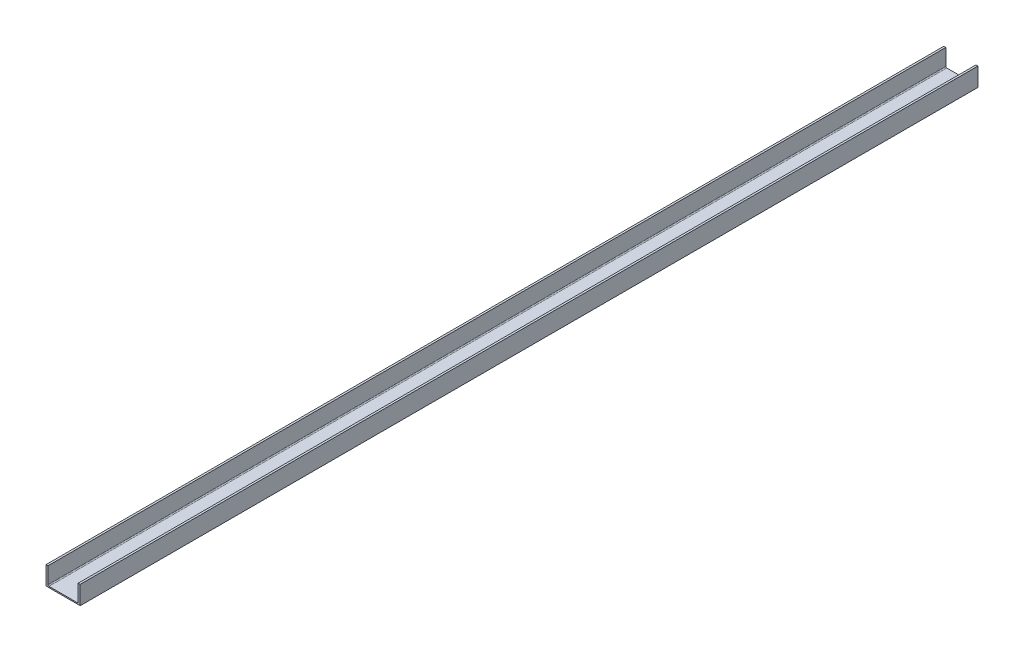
ISO-10303-21;
HEADER;
FILE_DESCRIPTION(('STEP AP214'),'2;1');
FILE_NAME('part.step','',(''),(''),'','','');
FILE_SCHEMA(('AUTOMOTIVE_DESIGN { 1 0 10303 214 1 1 1 1 }'));
ENDSEC;
DATA;
#1=APPLICATION_CONTEXT('core data for automotive mechanical design processes');
#2=APPLICATION_PROTOCOL_DEFINITION('international standard','automotive_design',2000,#1);
#3=PRODUCT_CONTEXT('',#1,'mechanical');
#4=PRODUCT('Part','Part','',(#3));
#5=PRODUCT_RELATED_PRODUCT_CATEGORY('part','',(#4));
#6=PRODUCT_DEFINITION_FORMATION('','',#4);
#7=PRODUCT_DEFINITION_CONTEXT('part definition',#1,'design');
#8=PRODUCT_DEFINITION('design','',#6,#7);
#9=PRODUCT_DEFINITION_SHAPE('','',#8);
#10=(LENGTH_UNIT() NAMED_UNIT(*) SI_UNIT(.MILLI.,.METRE.));
#11=(NAMED_UNIT(*) PLANE_ANGLE_UNIT() SI_UNIT($,.RADIAN.));
#12=(NAMED_UNIT(*) SI_UNIT($,.STERADIAN.) SOLID_ANGLE_UNIT());
#13=UNCERTAINTY_MEASURE_WITH_UNIT(LENGTH_MEASURE(1.E-05),#10,'distance_accuracy_value','');
#14=(GEOMETRIC_REPRESENTATION_CONTEXT(3) GLOBAL_UNCERTAINTY_ASSIGNED_CONTEXT((#13)) GLOBAL_UNIT_ASSIGNED_CONTEXT((#10,
#11,#12)) REPRESENTATION_CONTEXT('',''));
#15=CARTESIAN_POINT('',(0.,0.,0.));
#16=DIRECTION('',(0.,0.,1.));
#17=DIRECTION('',(1.,0.,0.));
#18=AXIS2_PLACEMENT_3D('',#15,#16,#17);
#19=CARTESIAN_POINT('',(-67.3100000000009,41.2749999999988,2000.18000000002));
#20=DIRECTION('',(0.,-1.,0.));
#21=DIRECTION('',(0.,0.,-1.00000000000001));
#22=AXIS2_PLACEMENT_3D('',#19,#20,#21);
#23=PLANE('',#22);
#24=DIRECTION('',(-1.00000000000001,0.,0.));
#25=VECTOR('',#24,1.);
#26=CARTESIAN_POINT('',(-67.3099999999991,41.2749999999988,-2000.18));
#27=LINE('',#26,#25);
#28=CARTESIAN_POINT('',(-67.3099999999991,41.2749999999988,-2000.18));
#29=VERTEX_POINT('',#28);
#30=CARTESIAN_POINT('',(-76.2,41.2749999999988,-2000.18));
#31=VERTEX_POINT('',#30);
#32=EDGE_CURVE('E189',#29,#31,#27,.T.);
#33=ORIENTED_EDGE('',*,*,#32,.T.);
#34=DIRECTION('',(0.,0.,-1.00000000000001));
#35=VECTOR('',#34,1.);
#36=CARTESIAN_POINT('',(-76.2,41.2749999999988,2000.18000000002));
#37=LINE('',#36,#35);
#38=CARTESIAN_POINT('',(-76.2,41.2749999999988,2000.18000000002));
#39=VERTEX_POINT('',#38);
#40=EDGE_CURVE('E169',#39,#31,#37,.T.);
#41=ORIENTED_EDGE('',*,*,#40,.F.);
#42=DIRECTION('',(-1.00000000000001,0.,0.));
#43=VECTOR('',#42,1.);
#44=CARTESIAN_POINT('',(-67.3100000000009,41.2749999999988,2000.18000000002));
#45=LINE('',#44,#43);
#46=CARTESIAN_POINT('',(-67.3100000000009,41.2749999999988,2000.18000000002));
#47=VERTEX_POINT('',#46);
#48=EDGE_CURVE('E176',#47,#39,#45,.T.);
#49=ORIENTED_EDGE('',*,*,#48,.F.);
#50=DIRECTION('',(0.,0.,-1.00000000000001));
#51=VECTOR('',#50,1.);
#52=CARTESIAN_POINT('',(-67.3100000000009,41.2749999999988,2000.18000000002));
#53=LINE('',#52,#51);
#54=EDGE_CURVE('E235',#47,#29,#53,.T.);
#55=ORIENTED_EDGE('',*,*,#54,.T.);
#56=EDGE_LOOP('',(#33,#41,#49,#55));
#57=FACE_BOUND('',#56,.T.);
#58=ADVANCED_FACE('F89',(#57),#23,.F.);
#59=CARTESIAN_POINT('',(-76.2,41.2749999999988,2000.18000000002));
#60=DIRECTION('',(1.00000000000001,0.,0.));
#61=DIRECTION('',(0.,1.,0.));
#62=AXIS2_PLACEMENT_3D('',#59,#60,#61);
#63=PLANE('',#62);
#64=DIRECTION('',(0.,-1.,0.));
#65=VECTOR('',#64,1.);
#66=CARTESIAN_POINT('',(-76.2,41.2749999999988,-2000.18));
#67=LINE('',#66,#65);
#68=CARTESIAN_POINT('',(-76.2,-41.2749999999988,-2000.18));
#69=VERTEX_POINT('',#68);
#70=EDGE_CURVE('E250',#31,#69,#67,.T.);
#71=ORIENTED_EDGE('',*,*,#70,.T.);
#72=DIRECTION('',(0.,0.,-1.00000000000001));
#73=VECTOR('',#72,1.);
#74=CARTESIAN_POINT('',(-76.2,-41.2749999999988,2000.18000000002));
#75=LINE('',#74,#73);
#76=CARTESIAN_POINT('',(-76.2,-41.2749999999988,2000.18000000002));
#77=VERTEX_POINT('',#76);
#78=EDGE_CURVE('E175',#77,#69,#75,.T.);
#79=ORIENTED_EDGE('',*,*,#78,.F.);
#80=DIRECTION('',(0.,-1.,0.));
#81=VECTOR('',#80,1.);
#82=CARTESIAN_POINT('',(-76.2,41.2749999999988,2000.18000000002));
#83=LINE('',#82,#81);
#84=EDGE_CURVE('E164',#39,#77,#83,.T.);
#85=ORIENTED_EDGE('',*,*,#84,.F.);
#86=ORIENTED_EDGE('',*,*,#40,.T.);
#87=EDGE_LOOP('',(#71,#79,#85,#86));
#88=FACE_BOUND('',#87,.T.);
#89=ADVANCED_FACE('F170',(#88),#63,.F.);
#90=CARTESIAN_POINT('',(-76.2,-41.2749999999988,2000.18000000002));
#91=DIRECTION('',(0.,1.,0.));
#92=DIRECTION('',(-1.00000000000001,0.,0.));
#93=AXIS2_PLACEMENT_3D('',#90,#91,#92);
#94=PLANE('',#93);
#95=DIRECTION('',(1.00000000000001,0.,0.));
#96=VECTOR('',#95,1.);
#97=CARTESIAN_POINT('',(-76.2,-41.2749999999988,-2000.18));
#98=LINE('',#97,#96);
#99=CARTESIAN_POINT('',(76.2,-41.2749999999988,-2000.18000000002));
#100=VERTEX_POINT('',#99);
#101=EDGE_CURVE('E249',#69,#100,#98,.T.);
#102=ORIENTED_EDGE('',*,*,#101,.T.);
#103=DIRECTION('',(0.,0.,-1.00000000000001));
#104=VECTOR('',#103,1.);
#105=CARTESIAN_POINT('',(76.2,-41.2749999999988,2000.18000000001));
#106=LINE('',#105,#104);
#107=CARTESIAN_POINT('',(76.2,-41.2749999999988,2000.18000000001));
#108=VERTEX_POINT('',#107);
#109=EDGE_CURVE('E197',#108,#100,#106,.T.);
#110=ORIENTED_EDGE('',*,*,#109,.F.);
#111=DIRECTION('',(1.00000000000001,0.,0.));
#112=VECTOR('',#111,1.);
#113=CARTESIAN_POINT('',(-76.2,-41.2749999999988,2000.18000000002));
#114=LINE('',#113,#112);
#115=EDGE_CURVE('E174',#77,#108,#114,.T.);
#116=ORIENTED_EDGE('',*,*,#115,.F.);
#117=ORIENTED_EDGE('',*,*,#78,.T.);
#118=EDGE_LOOP('',(#102,#110,#116,#117));
#119=FACE_BOUND('',#118,.T.);
#120=ADVANCED_FACE('F302',(#119),#94,.F.);
#121=CARTESIAN_POINT('',(76.2,-41.2749999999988,2000.18000000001));
#122=DIRECTION('',(-1.00000000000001,0.,0.));
#123=DIRECTION('',(0.,-1.,0.));
#124=AXIS2_PLACEMENT_3D('',#121,#122,#123);
#125=PLANE('',#124);
#126=DIRECTION('',(0.,1.,0.));
#127=VECTOR('',#126,1.);
#128=CARTESIAN_POINT('',(76.2,-41.2749999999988,-2000.18000000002));
#129=LINE('',#128,#127);
#130=CARTESIAN_POINT('',(76.2,41.2749999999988,-2000.18000000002));
#131=VERTEX_POINT('',#130);
#132=EDGE_CURVE('E254',#100,#131,#129,.T.);
#133=ORIENTED_EDGE('',*,*,#132,.T.);
#134=DIRECTION('',(0.,0.,-1.00000000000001));
#135=VECTOR('',#134,1.);
#136=CARTESIAN_POINT('',(76.2,41.2749999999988,2000.18000000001));
#137=LINE('',#136,#135);
#138=CARTESIAN_POINT('',(76.2,41.2749999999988,2000.18000000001));
#139=VERTEX_POINT('',#138);
#140=EDGE_CURVE('E267',#139,#131,#137,.T.);
#141=ORIENTED_EDGE('',*,*,#140,.F.);
#142=DIRECTION('',(0.,1.,0.));
#143=VECTOR('',#142,1.);
#144=CARTESIAN_POINT('',(76.2,-41.2749999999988,2000.18000000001));
#145=LINE('',#144,#143);
#146=EDGE_CURVE('E278',#108,#139,#145,.T.);
#147=ORIENTED_EDGE('',*,*,#146,.F.);
#148=ORIENTED_EDGE('',*,*,#109,.T.);
#149=EDGE_LOOP('',(#133,#141,#147,#148));
#150=FACE_BOUND('',#149,.T.);
#151=ADVANCED_FACE('F276',(#150),#125,.F.);
#152=CARTESIAN_POINT('',(76.2,41.2749999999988,2000.18000000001));
#153=DIRECTION('',(0.,-1.,0.));
#154=DIRECTION('',(1.00000000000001,0.,0.));
#155=AXIS2_PLACEMENT_3D('',#152,#153,#154);
#156=PLANE('',#155);
#157=DIRECTION('',(-1.00000000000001,0.,0.));
#158=VECTOR('',#157,1.);
#159=CARTESIAN_POINT('',(76.2,41.2749999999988,-2000.18000000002));
#160=LINE('',#159,#158);
#161=CARTESIAN_POINT('',(67.3100000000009,41.2749999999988,-2000.18000000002));
#162=VERTEX_POINT('',#161);
#163=EDGE_CURVE('E259',#131,#162,#160,.T.);
#164=ORIENTED_EDGE('',*,*,#163,.T.);
#165=DIRECTION('',(0.,0.,-1.00000000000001));
#166=VECTOR('',#165,1.);
#167=CARTESIAN_POINT('',(67.3099999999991,41.2749999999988,2000.18000000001));
#168=LINE('',#167,#166);
#169=CARTESIAN_POINT('',(67.3099999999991,41.2749999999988,2000.18000000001));
#170=VERTEX_POINT('',#169);
#171=EDGE_CURVE('E237',#170,#162,#168,.T.);
#172=ORIENTED_EDGE('',*,*,#171,.F.);
#173=DIRECTION('',(-1.00000000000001,0.,0.));
#174=VECTOR('',#173,1.);
#175=CARTESIAN_POINT('',(76.2,41.2749999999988,2000.18000000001));
#176=LINE('',#175,#174);
#177=EDGE_CURVE('E294',#139,#170,#176,.T.);
#178=ORIENTED_EDGE('',*,*,#177,.F.);
#179=ORIENTED_EDGE('',*,*,#140,.T.);
#180=EDGE_LOOP('',(#164,#172,#178,#179));
#181=FACE_BOUND('',#180,.T.);
#182=ADVANCED_FACE('F286',(#181),#156,.F.);
#183=CARTESIAN_POINT('',(67.3099999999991,41.2749999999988,2000.18000000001));
#184=DIRECTION('',(1.00000000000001,0.,0.));
#185=DIRECTION('',(0.,1.,0.));
#186=AXIS2_PLACEMENT_3D('',#183,#184,#185);
#187=PLANE('',#186);
#188=DIRECTION('',(0.,-1.,0.));
#189=VECTOR('',#188,1.);
#190=CARTESIAN_POINT('',(67.3100000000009,41.2749999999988,-2000.18000000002));
#191=LINE('',#190,#189);
#192=CARTESIAN_POINT('',(67.3100000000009,-31.4960000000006,-2000.18000000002));
#193=VERTEX_POINT('',#192);
#194=EDGE_CURVE('E226',#162,#193,#191,.T.);
#195=ORIENTED_EDGE('',*,*,#194,.T.);
#196=DIRECTION('',(0.,0.,-1.00000000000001));
#197=VECTOR('',#196,1.);
#198=CARTESIAN_POINT('',(67.3099999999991,-31.4960000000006,2000.18000000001));
#199=LINE('',#198,#197);
#200=CARTESIAN_POINT('',(67.3099999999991,-31.4960000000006,2000.18000000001));
#201=VERTEX_POINT('',#200);
#202=EDGE_CURVE('E203',#193,#201,#199,.F.);
#203=ORIENTED_EDGE('',*,*,#202,.T.);
#204=DIRECTION('',(0.,-1.,0.));
#205=VECTOR('',#204,1.);
#206=CARTESIAN_POINT('',(67.3099999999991,41.2749999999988,2000.18000000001));
#207=LINE('',#206,#205);
#208=EDGE_CURVE('E241',#170,#201,#207,.T.);
#209=ORIENTED_EDGE('',*,*,#208,.F.);
#210=ORIENTED_EDGE('',*,*,#171,.T.);
#211=EDGE_LOOP('',(#195,#203,#209,#210));
#212=FACE_BOUND('',#211,.T.);
#213=ADVANCED_FACE('F290',(#212),#187,.F.);
#214=CARTESIAN_POINT('',(67.3099999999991,-35.9410000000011,2000.18000000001));
#215=DIRECTION('',(0.,-1.,0.));
#216=DIRECTION('',(1.00000000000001,0.,0.));
#217=AXIS2_PLACEMENT_3D('',#214,#215,#216);
#218=PLANE('',#217);
#219=DIRECTION('',(-1.00000000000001,0.,0.));
#220=VECTOR('',#219,1.);
#221=CARTESIAN_POINT('',(67.3099999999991,-35.9410000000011,2000.18000000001));
#222=LINE('',#221,#220);
#223=CARTESIAN_POINT('',(62.8650000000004,-35.9410000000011,2000.18000000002));
#224=VERTEX_POINT('',#223);
#225=CARTESIAN_POINT('',(-62.8650000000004,-35.9410000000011,2000.18000000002));
#226=VERTEX_POINT('',#225);
#227=EDGE_CURVE('E234',#224,#226,#222,.T.);
#228=ORIENTED_EDGE('',*,*,#227,.F.);
#229=DIRECTION('',(0.,0.,-1.00000000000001));
#230=VECTOR('',#229,1.);
#231=CARTESIAN_POINT('',(62.8650000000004,-35.9410000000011,-2000.18));
#232=LINE('',#231,#230);
#233=CARTESIAN_POINT('',(62.8650000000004,-35.9410000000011,-2000.18));
#234=VERTEX_POINT('',#233);
#235=EDGE_CURVE('E192',#224,#234,#232,.T.);
#236=ORIENTED_EDGE('',*,*,#235,.T.);
#237=DIRECTION('',(-1.00000000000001,0.,0.));
#238=VECTOR('',#237,1.);
#239=CARTESIAN_POINT('',(67.3100000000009,-35.9410000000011,-2000.18000000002));
#240=LINE('',#239,#238);
#241=CARTESIAN_POINT('',(-62.8650000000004,-35.9410000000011,-2000.18000000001));
#242=VERTEX_POINT('',#241);
#243=EDGE_CURVE('E222',#234,#242,#240,.T.);
#244=ORIENTED_EDGE('',*,*,#243,.T.);
#245=DIRECTION('',(0.,0.,-1.00000000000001));
#246=VECTOR('',#245,1.);
#247=CARTESIAN_POINT('',(-62.8650000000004,-35.9410000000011,2000.18000000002));
#248=LINE('',#247,#246);
#249=EDGE_CURVE('E188',#242,#226,#248,.F.);
#250=ORIENTED_EDGE('',*,*,#249,.T.);
#251=EDGE_LOOP('',(#228,#236,#244,#250));
#252=FACE_BOUND('',#251,.T.);
#253=ADVANCED_FACE('F225',(#252),#218,.F.);
#254=CARTESIAN_POINT('',(-67.3100000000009,-35.9410000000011,2000.18000000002));
#255=DIRECTION('',(-1.00000000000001,0.,0.));
#256=DIRECTION('',(0.,-1.,0.));
#257=AXIS2_PLACEMENT_3D('',#254,#255,#256);
#258=PLANE('',#257);
#259=DIRECTION('',(0.,1.,0.));
#260=VECTOR('',#259,1.);
#261=CARTESIAN_POINT('',(-67.3100000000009,-35.9410000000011,2000.18000000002));
#262=LINE('',#261,#260);
#263=CARTESIAN_POINT('',(-67.3100000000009,-31.4960000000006,2000.18000000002));
#264=VERTEX_POINT('',#263);
#265=EDGE_CURVE('E179',#264,#47,#262,.T.);
#266=ORIENTED_EDGE('',*,*,#265,.F.);
#267=DIRECTION('',(0.,0.,-1.00000000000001));
#268=VECTOR('',#267,1.);
#269=CARTESIAN_POINT('',(-67.3099999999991,-31.4960000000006,-2000.18));
#270=LINE('',#269,#268);
#271=CARTESIAN_POINT('',(-67.3099999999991,-31.4960000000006,-2000.18));
#272=VERTEX_POINT('',#271);
#273=EDGE_CURVE('E210',#264,#272,#270,.T.);
#274=ORIENTED_EDGE('',*,*,#273,.T.);
#275=DIRECTION('',(0.,1.,0.));
#276=VECTOR('',#275,1.);
#277=CARTESIAN_POINT('',(-67.3099999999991,-35.9410000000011,-2000.18));
#278=LINE('',#277,#276);
#279=EDGE_CURVE('E184',#272,#29,#278,.T.);
#280=ORIENTED_EDGE('',*,*,#279,.T.);
#281=ORIENTED_EDGE('',*,*,#54,.F.);
#282=EDGE_LOOP('',(#266,#274,#280,#281));
#283=FACE_BOUND('',#282,.T.);
#284=ADVANCED_FACE('F233',(#283),#258,.F.);
#285=CARTESIAN_POINT('',(0.,0.,2000.18000000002));
#286=DIRECTION('',(0.,0.,1.00000000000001));
#287=DIRECTION('',(1.00000000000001,0.,0.));
#288=AXIS2_PLACEMENT_3D('',#285,#286,#287);
#289=PLANE('',#288);
#290=ORIENTED_EDGE('',*,*,#48,.T.);
#291=ORIENTED_EDGE('',*,*,#84,.T.);
#292=ORIENTED_EDGE('',*,*,#115,.T.);
#293=ORIENTED_EDGE('',*,*,#146,.T.);
#294=ORIENTED_EDGE('',*,*,#177,.T.);
#295=ORIENTED_EDGE('',*,*,#208,.T.);
#296=CARTESIAN_POINT('',(62.8650000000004,-31.4960000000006,2000.18000000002));
#297=DIRECTION('',(0.,0.,1.00000000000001));
#298=DIRECTION('',(1.00000000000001,0.,0.));
#299=AXIS2_PLACEMENT_3D('',#296,#297,#298);
#300=CIRCLE('',#299,4.445);
#301=EDGE_CURVE('E215',#201,#224,#300,.F.);
#302=ORIENTED_EDGE('',*,*,#301,.T.);
#303=ORIENTED_EDGE('',*,*,#227,.T.);
#304=CARTESIAN_POINT('',(-62.8650000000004,-31.4960000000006,2000.18000000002));
#305=DIRECTION('',(0.,0.,1.00000000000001));
#306=DIRECTION('',(1.00000000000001,0.,0.));
#307=AXIS2_PLACEMENT_3D('',#304,#305,#306);
#308=CIRCLE('',#307,4.445);
#309=EDGE_CURVE('E12',#226,#264,#308,.F.);
#310=ORIENTED_EDGE('',*,*,#309,.T.);
#311=ORIENTED_EDGE('',*,*,#265,.T.);
#312=EDGE_LOOP('',(#290,#291,#292,#293,#294,#295,#302,#303,#310,#311));
#313=FACE_BOUND('',#312,.T.);
#314=ADVANCED_FACE('F177',(#313),#289,.T.);
#315=CARTESIAN_POINT('',(0.,0.,-2000.18000000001));
#316=DIRECTION('',(0.,0.,1.00000000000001));
#317=DIRECTION('',(1.00000000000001,0.,0.));
#318=AXIS2_PLACEMENT_3D('',#315,#316,#317);
#319=PLANE('',#318);
#320=ORIENTED_EDGE('',*,*,#32,.F.);
#321=ORIENTED_EDGE('',*,*,#279,.F.);
#322=CARTESIAN_POINT('',(-62.8650000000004,-31.4960000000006,-2000.18000000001));
#323=DIRECTION('',(0.,0.,1.00000000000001));
#324=DIRECTION('',(1.00000000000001,0.,0.));
#325=AXIS2_PLACEMENT_3D('',#322,#323,#324);
#326=CIRCLE('',#325,4.445);
#327=EDGE_CURVE('E97',#272,#242,#326,.T.);
#328=ORIENTED_EDGE('',*,*,#327,.T.);
#329=ORIENTED_EDGE('',*,*,#243,.F.);
#330=CARTESIAN_POINT('',(62.8650000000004,-31.4960000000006,-2000.18));
#331=DIRECTION('',(0.,0.,1.00000000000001));
#332=DIRECTION('',(1.00000000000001,0.,0.));
#333=AXIS2_PLACEMENT_3D('',#330,#331,#332);
#334=CIRCLE('',#333,4.445);
#335=EDGE_CURVE('E208',#234,#193,#334,.T.);
#336=ORIENTED_EDGE('',*,*,#335,.T.);
#337=ORIENTED_EDGE('',*,*,#194,.F.);
#338=ORIENTED_EDGE('',*,*,#163,.F.);
#339=ORIENTED_EDGE('',*,*,#132,.F.);
#340=ORIENTED_EDGE('',*,*,#101,.F.);
#341=ORIENTED_EDGE('',*,*,#70,.F.);
#342=EDGE_LOOP('',(#320,#321,#328,#329,#336,#337,#338,#339,#340,#341));
#343=FACE_BOUND('',#342,.T.);
#344=ADVANCED_FACE('F221',(#343),#319,.F.);
#345=CARTESIAN_POINT('',(62.8650000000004,-31.4960000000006,2000.18000000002));
#346=DIRECTION('',(0.,0.,1.00000000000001));
#347=DIRECTION('',(1.00000000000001,0.,0.));
#348=AXIS2_PLACEMENT_3D('',#345,#346,#347);
#349=CYLINDRICAL_SURFACE('',#348,4.445);
#350=ORIENTED_EDGE('',*,*,#301,.F.);
#351=ORIENTED_EDGE('',*,*,#202,.F.);
#352=ORIENTED_EDGE('',*,*,#335,.F.);
#353=ORIENTED_EDGE('',*,*,#235,.F.);
#354=EDGE_LOOP('',(#350,#351,#352,#353));
#355=FACE_BOUND('',#354,.T.);
#356=ADVANCED_FACE('F316',(#355),#349,.F.);
#357=CARTESIAN_POINT('',(-62.8650000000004,-31.4960000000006,2000.18000000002));
#358=DIRECTION('',(0.,0.,1.00000000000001));
#359=DIRECTION('',(1.00000000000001,0.,0.));
#360=AXIS2_PLACEMENT_3D('',#357,#358,#359);
#361=CYLINDRICAL_SURFACE('',#360,4.445);
#362=ORIENTED_EDGE('',*,*,#309,.F.);
#363=ORIENTED_EDGE('',*,*,#249,.F.);
#364=ORIENTED_EDGE('',*,*,#327,.F.);
#365=ORIENTED_EDGE('',*,*,#273,.F.);
#366=EDGE_LOOP('',(#362,#363,#364,#365));
#367=FACE_BOUND('',#366,.T.);
#368=ADVANCED_FACE('F90',(#367),#361,.F.);
#369=CLOSED_SHELL('',(#58,#89,#120,#151,#182,#213,#253,#284,#314,#344,#356,#368));
#370=MANIFOLD_SOLID_BREP('B2',#369);
#371=ADVANCED_BREP_SHAPE_REPRESENTATION('',(#18,#370),#14);
#372=SHAPE_DEFINITION_REPRESENTATION(#9,#371);
ENDSEC;
END-ISO-10303-21;
